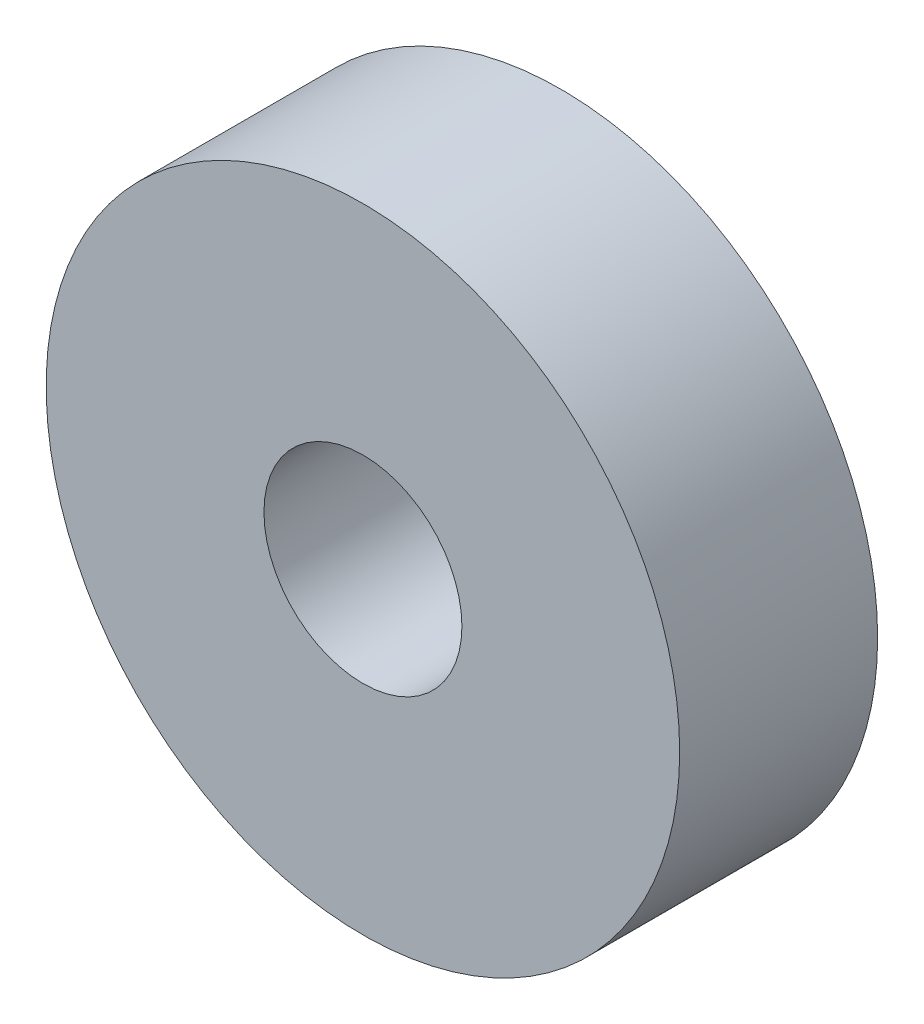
from build123d import *

# Parameters (mm, degrees)
CROQUIS1_R              = 8
CROQUIS1_R_2            = 2.5
SALIENTE_EXTRUIR1_DEPTH = 5


with BuildPart() as part:
    # Croquis1 → Saliente-Extruir1 (new body)
    with BuildSketch(Plane.XY):
        Circle(CROQUIS1_R)
        Circle(CROQUIS1_R_2, mode=Mode.SUBTRACT)
    extrude(amount=SALIENTE_EXTRUIR1_DEPTH)


solid = part.part
